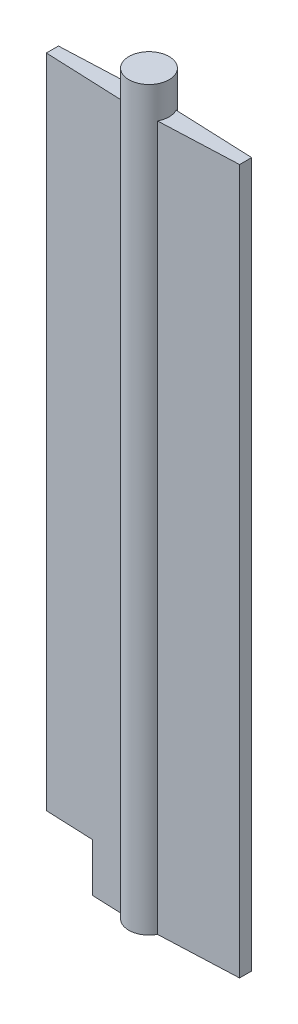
ISO-10303-21;
HEADER;
FILE_DESCRIPTION(('STEP AP214'),'2;1');
FILE_NAME('part.step','',(''),(''),'','','');
FILE_SCHEMA(('AUTOMOTIVE_DESIGN { 1 0 10303 214 1 1 1 1 }'));
ENDSEC;
DATA;
#1=APPLICATION_CONTEXT('core data for automotive mechanical design processes');
#2=APPLICATION_PROTOCOL_DEFINITION('international standard','automotive_design',2000,#1);
#3=PRODUCT_CONTEXT('',#1,'mechanical');
#4=PRODUCT('Part','Part','',(#3));
#5=PRODUCT_RELATED_PRODUCT_CATEGORY('part','',(#4));
#6=PRODUCT_DEFINITION_FORMATION('','',#4);
#7=PRODUCT_DEFINITION_CONTEXT('part definition',#1,'design');
#8=PRODUCT_DEFINITION('design','',#6,#7);
#9=PRODUCT_DEFINITION_SHAPE('','',#8);
#10=(LENGTH_UNIT() NAMED_UNIT(*) SI_UNIT(.MILLI.,.METRE.));
#11=(NAMED_UNIT(*) PLANE_ANGLE_UNIT() SI_UNIT($,.RADIAN.));
#12=(NAMED_UNIT(*) SI_UNIT($,.STERADIAN.) SOLID_ANGLE_UNIT());
#13=UNCERTAINTY_MEASURE_WITH_UNIT(LENGTH_MEASURE(1.E-05),#10,'distance_accuracy_value','');
#14=(GEOMETRIC_REPRESENTATION_CONTEXT(3) GLOBAL_UNCERTAINTY_ASSIGNED_CONTEXT((#13)) GLOBAL_UNIT_ASSIGNED_CONTEXT((#10,
#11,#12)) REPRESENTATION_CONTEXT('',''));
#15=CARTESIAN_POINT('',(0.,0.,0.));
#16=DIRECTION('',(0.,0.,1.));
#17=DIRECTION('',(1.,0.,0.));
#18=AXIS2_PLACEMENT_3D('',#15,#16,#17);
#19=CARTESIAN_POINT('',(0.,222.25,0.));
#20=DIRECTION('',(0.,1.,0.));
#21=DIRECTION('',(0.,0.,1.));
#22=AXIS2_PLACEMENT_3D('',#19,#20,#21);
#23=PLANE('',#22);
#24=CARTESIAN_POINT('',(0.,222.25,0.));
#25=DIRECTION('',(0.,1.,0.));
#26=DIRECTION('',(0.,0.,1.));
#27=AXIS2_PLACEMENT_3D('',#24,#25,#26);
#28=CIRCLE('',#27,6.35);
#29=CARTESIAN_POINT('',(5.62814310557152,222.25,2.94049403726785));
#30=VERTEX_POINT('',#29);
#31=CARTESIAN_POINT('',(5.62814310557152,222.25,-2.94049403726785));
#32=VERTEX_POINT('',#31);
#33=EDGE_CURVE('E174',#30,#32,#28,.T.);
#34=ORIENTED_EDGE('',*,*,#33,.F.);
#35=DIRECTION('',(-0.999133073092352,0.,0.0416305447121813));
#36=VECTOR('',#35,1.);
#37=CARTESIAN_POINT('',(0.132062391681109,222.25,3.16949740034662));
#38=LINE('',#37,#36);
#39=CARTESIAN_POINT('',(30.48,222.25,1.905));
#40=VERTEX_POINT('',#39);
#41=EDGE_CURVE('E220',#40,#30,#38,.T.);
#42=ORIENTED_EDGE('',*,*,#41,.F.);
#43=DIRECTION('',(0.,0.,1.));
#44=VECTOR('',#43,1.);
#45=CARTESIAN_POINT('',(30.48,222.25,0.));
#46=LINE('',#45,#44);
#47=CARTESIAN_POINT('',(30.48,222.25,-1.905));
#48=VERTEX_POINT('',#47);
#49=EDGE_CURVE('E225',#48,#40,#46,.T.);
#50=ORIENTED_EDGE('',*,*,#49,.F.);
#51=DIRECTION('',(0.999133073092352,0.,0.0416305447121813));
#52=VECTOR('',#51,1.);
#53=CARTESIAN_POINT('',(0.132062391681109,222.25,-3.16949740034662));
#54=LINE('',#53,#52);
#55=EDGE_CURVE('E216',#32,#48,#54,.T.);
#56=ORIENTED_EDGE('',*,*,#55,.F.);
#57=EDGE_LOOP('',(#34,#42,#50,#56));
#58=FACE_BOUND('',#57,.T.);
#59=ADVANCED_FACE('F68',(#58),#23,.T.);
#60=CARTESIAN_POINT('',(0.132062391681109,222.25,3.16949740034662));
#61=DIRECTION('',(0.0416305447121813,0.,0.999133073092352));
#62=DIRECTION('',(0.999133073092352,0.,-0.0416305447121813));
#63=AXIS2_PLACEMENT_3D('',#60,#61,#62);
#64=PLANE('',#63);
#65=DIRECTION('',(-0.999133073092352,0.,0.0416305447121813));
#66=VECTOR('',#65,1.);
#67=CARTESIAN_POINT('',(0.132062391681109,0.,3.16949740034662));
#68=LINE('',#67,#66);
#69=CARTESIAN_POINT('',(30.48,0.,1.905));
#70=VERTEX_POINT('',#69);
#71=CARTESIAN_POINT('',(5.62814310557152,0.,2.94049403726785));
#72=VERTEX_POINT('',#71);
#73=EDGE_CURVE('E161',#70,#72,#68,.T.);
#74=ORIENTED_EDGE('',*,*,#73,.F.);
#75=DIRECTION('',(0.,-1.,0.));
#76=VECTOR('',#75,1.);
#77=CARTESIAN_POINT('',(30.48,222.25,1.905));
#78=LINE('',#77,#76);
#79=EDGE_CURVE('E175',#40,#70,#78,.T.);
#80=ORIENTED_EDGE('',*,*,#79,.F.);
#81=ORIENTED_EDGE('',*,*,#41,.T.);
#82=DIRECTION('',(0.,-1.,0.));
#83=VECTOR('',#82,1.);
#84=CARTESIAN_POINT('',(5.62814310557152,222.25,2.94049403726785));
#85=LINE('',#84,#83);
#86=EDGE_CURVE('E172',#30,#72,#85,.T.);
#87=ORIENTED_EDGE('',*,*,#86,.T.);
#88=EDGE_LOOP('',(#74,#80,#81,#87));
#89=FACE_BOUND('',#88,.T.);
#90=ADVANCED_FACE('F231',(#89),#64,.T.);
#91=CARTESIAN_POINT('',(30.48,222.25,0.));
#92=DIRECTION('',(1.,0.,0.));
#93=DIRECTION('',(0.,0.,-1.));
#94=AXIS2_PLACEMENT_3D('',#91,#92,#93);
#95=PLANE('',#94);
#96=DIRECTION('',(0.,0.,1.));
#97=VECTOR('',#96,1.);
#98=CARTESIAN_POINT('',(30.48,0.,0.));
#99=LINE('',#98,#97);
#100=CARTESIAN_POINT('',(30.48,0.,-1.905));
#101=VERTEX_POINT('',#100);
#102=EDGE_CURVE('E221',#101,#70,#99,.T.);
#103=ORIENTED_EDGE('',*,*,#102,.F.);
#104=DIRECTION('',(0.,-1.,0.));
#105=VECTOR('',#104,1.);
#106=CARTESIAN_POINT('',(30.48,222.25,-1.905));
#107=LINE('',#106,#105);
#108=EDGE_CURVE('E213',#48,#101,#107,.T.);
#109=ORIENTED_EDGE('',*,*,#108,.F.);
#110=ORIENTED_EDGE('',*,*,#49,.T.);
#111=ORIENTED_EDGE('',*,*,#79,.T.);
#112=EDGE_LOOP('',(#103,#109,#110,#111));
#113=FACE_BOUND('',#112,.T.);
#114=ADVANCED_FACE('F238',(#113),#95,.T.);
#115=CARTESIAN_POINT('',(0.132062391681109,222.25,-3.16949740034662));
#116=DIRECTION('',(0.0416305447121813,0.,-0.999133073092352));
#117=DIRECTION('',(-0.999133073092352,0.,-0.0416305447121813));
#118=AXIS2_PLACEMENT_3D('',#115,#116,#117);
#119=PLANE('',#118);
#120=DIRECTION('',(0.999133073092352,0.,0.0416305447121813));
#121=VECTOR('',#120,1.);
#122=CARTESIAN_POINT('',(0.132062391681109,0.,-3.16949740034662));
#123=LINE('',#122,#121);
#124=CARTESIAN_POINT('',(5.62814310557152,0.,-2.94049403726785));
#125=VERTEX_POINT('',#124);
#126=EDGE_CURVE('E217',#125,#101,#123,.T.);
#127=ORIENTED_EDGE('',*,*,#126,.F.);
#128=DIRECTION('',(0.,-1.,0.));
#129=VECTOR('',#128,1.);
#130=CARTESIAN_POINT('',(5.62814310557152,222.25,-2.94049403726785));
#131=LINE('',#130,#129);
#132=EDGE_CURVE('E92',#32,#125,#131,.T.);
#133=ORIENTED_EDGE('',*,*,#132,.F.);
#134=ORIENTED_EDGE('',*,*,#55,.T.);
#135=ORIENTED_EDGE('',*,*,#108,.T.);
#136=EDGE_LOOP('',(#127,#133,#134,#135));
#137=FACE_BOUND('',#136,.T.);
#138=ADVANCED_FACE('F235',(#137),#119,.T.);
#139=CARTESIAN_POINT('',(0.,0.,0.));
#140=DIRECTION('',(0.,1.,0.));
#141=DIRECTION('',(0.,0.,1.));
#142=AXIS2_PLACEMENT_3D('',#139,#140,#141);
#143=PLANE('',#142);
#144=DIRECTION('',(0.999133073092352,0.,0.0416305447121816));
#145=VECTOR('',#144,1.);
#146=CARTESIAN_POINT('',(-0.13206239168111,0.,3.16949740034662));
#147=LINE('',#146,#145);
#148=CARTESIAN_POINT('',(-15.24,0.,2.53999999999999));
#149=VERTEX_POINT('',#148);
#150=CARTESIAN_POINT('',(-5.62814310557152,0.,2.94049403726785));
#151=VERTEX_POINT('',#150);
#152=EDGE_CURVE('E130',#149,#151,#147,.T.);
#153=ORIENTED_EDGE('',*,*,#152,.F.);
#154=DIRECTION('',(0.,0.,1.));
#155=VECTOR('',#154,1.);
#156=CARTESIAN_POINT('',(-15.24,0.,-6.35));
#157=LINE('',#156,#155);
#158=CARTESIAN_POINT('',(-15.24,0.,-2.54));
#159=VERTEX_POINT('',#158);
#160=EDGE_CURVE('E189',#159,#149,#157,.T.);
#161=ORIENTED_EDGE('',*,*,#160,.F.);
#162=DIRECTION('',(-0.999133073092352,0.,0.0416305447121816));
#163=VECTOR('',#162,1.);
#164=CARTESIAN_POINT('',(-0.13206239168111,0.,-3.16949740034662));
#165=LINE('',#164,#163);
#166=CARTESIAN_POINT('',(-5.62814310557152,0.,-2.94049403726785));
#167=VERTEX_POINT('',#166);
#168=EDGE_CURVE('E144',#167,#159,#165,.T.);
#169=ORIENTED_EDGE('',*,*,#168,.F.);
#170=CARTESIAN_POINT('',(0.,0.,0.));
#171=DIRECTION('',(0.,1.,0.));
#172=DIRECTION('',(0.,0.,1.));
#173=AXIS2_PLACEMENT_3D('',#170,#171,#172);
#174=CIRCLE('',#173,6.35);
#175=EDGE_CURVE('E162',#125,#167,#174,.T.);
#176=ORIENTED_EDGE('',*,*,#175,.F.);
#177=ORIENTED_EDGE('',*,*,#126,.T.);
#178=ORIENTED_EDGE('',*,*,#102,.T.);
#179=ORIENTED_EDGE('',*,*,#73,.T.);
#180=EDGE_CURVE('E151',#151,#72,#174,.T.);
#181=ORIENTED_EDGE('',*,*,#180,.F.);
#182=EDGE_LOOP('',(#153,#161,#169,#176,#177,#178,#179,#181));
#183=FACE_BOUND('',#182,.T.);
#184=ADVANCED_FACE('F158',(#183),#143,.F.);
#185=CARTESIAN_POINT('',(-5.62814310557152,222.25,-2.94049403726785));
#186=VERTEX_POINT('',#185);
#187=CARTESIAN_POINT('',(-5.62814310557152,222.25,2.94049403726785));
#188=VERTEX_POINT('',#187);
#189=EDGE_CURVE('E154',#186,#188,#28,.T.);
#190=ORIENTED_EDGE('',*,*,#189,.F.);
#191=DIRECTION('',(-0.999133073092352,0.,0.0416305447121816));
#192=VECTOR('',#191,1.);
#193=CARTESIAN_POINT('',(-0.13206239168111,222.25,-3.16949740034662));
#194=LINE('',#193,#192);
#195=CARTESIAN_POINT('',(-30.48,222.25,-1.90499999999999));
#196=VERTEX_POINT('',#195);
#197=EDGE_CURVE('E143',#186,#196,#194,.T.);
#198=ORIENTED_EDGE('',*,*,#197,.T.);
#199=DIRECTION('',(0.,0.,1.));
#200=VECTOR('',#199,1.);
#201=CARTESIAN_POINT('',(-30.48,222.25,0.));
#202=LINE('',#201,#200);
#203=CARTESIAN_POINT('',(-30.48,222.25,1.90499999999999));
#204=VERTEX_POINT('',#203);
#205=EDGE_CURVE('E209',#196,#204,#202,.T.);
#206=ORIENTED_EDGE('',*,*,#205,.T.);
#207=DIRECTION('',(0.999133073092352,0.,0.0416305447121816));
#208=VECTOR('',#207,1.);
#209=CARTESIAN_POINT('',(-0.13206239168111,222.25,3.16949740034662));
#210=LINE('',#209,#208);
#211=EDGE_CURVE('E156',#204,#188,#210,.T.);
#212=ORIENTED_EDGE('',*,*,#211,.T.);
#213=EDGE_LOOP('',(#190,#198,#206,#212));
#214=FACE_BOUND('',#213,.T.);
#215=ADVANCED_FACE('F246',(#214),#23,.T.);
#216=CARTESIAN_POINT('',(-30.48,222.25,0.));
#217=DIRECTION('',(1.,0.,0.));
#218=DIRECTION('',(0.,0.,-1.));
#219=AXIS2_PLACEMENT_3D('',#216,#217,#218);
#220=PLANE('',#219);
#221=DIRECTION('',(0.,-1.,0.));
#222=VECTOR('',#221,1.);
#223=CARTESIAN_POINT('',(-30.48,222.25,-1.90499999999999));
#224=LINE('',#223,#222);
#225=CARTESIAN_POINT('',(-30.48,15.24,-1.90499999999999));
#226=VERTEX_POINT('',#225);
#227=EDGE_CURVE('E203',#196,#226,#224,.T.);
#228=ORIENTED_EDGE('',*,*,#227,.T.);
#229=DIRECTION('',(0.,0.,1.));
#230=VECTOR('',#229,1.);
#231=CARTESIAN_POINT('',(-30.48,15.24,-6.35));
#232=LINE('',#231,#230);
#233=CARTESIAN_POINT('',(-30.48,15.24,1.90499999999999));
#234=VERTEX_POINT('',#233);
#235=EDGE_CURVE('E186',#226,#234,#232,.T.);
#236=ORIENTED_EDGE('',*,*,#235,.T.);
#237=DIRECTION('',(0.,-1.,0.));
#238=VECTOR('',#237,1.);
#239=CARTESIAN_POINT('',(-30.48,222.25,1.90499999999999));
#240=LINE('',#239,#238);
#241=EDGE_CURVE('E155',#204,#234,#240,.T.);
#242=ORIENTED_EDGE('',*,*,#241,.F.);
#243=ORIENTED_EDGE('',*,*,#205,.F.);
#244=EDGE_LOOP('',(#228,#236,#242,#243));
#245=FACE_BOUND('',#244,.T.);
#246=ADVANCED_FACE('F199',(#245),#220,.F.);
#247=CARTESIAN_POINT('',(-0.13206239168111,222.25,3.16949740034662));
#248=DIRECTION('',(0.0416305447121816,0.,-0.999133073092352));
#249=DIRECTION('',(-0.999133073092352,0.,-0.0416305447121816));
#250=AXIS2_PLACEMENT_3D('',#247,#248,#249);
#251=PLANE('',#250);
#252=ORIENTED_EDGE('',*,*,#241,.T.);
#253=DIRECTION('',(0.999133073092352,0.,0.0416305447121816));
#254=VECTOR('',#253,1.);
#255=CARTESIAN_POINT('',(-0.13206239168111,15.24,3.16949740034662));
#256=LINE('',#255,#254);
#257=CARTESIAN_POINT('',(-15.24,15.24,2.54));
#258=VERTEX_POINT('',#257);
#259=EDGE_CURVE('E180',#234,#258,#256,.T.);
#260=ORIENTED_EDGE('',*,*,#259,.T.);
#261=DIRECTION('',(0.,-1.,0.));
#262=VECTOR('',#261,1.);
#263=CARTESIAN_POINT('',(-15.24,222.25,2.54));
#264=LINE('',#263,#262);
#265=EDGE_CURVE('E139',#258,#149,#264,.T.);
#266=ORIENTED_EDGE('',*,*,#265,.T.);
#267=ORIENTED_EDGE('',*,*,#152,.T.);
#268=DIRECTION('',(0.,-1.,0.));
#269=VECTOR('',#268,1.);
#270=CARTESIAN_POINT('',(-5.62814310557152,222.25,2.94049403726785));
#271=LINE('',#270,#269);
#272=EDGE_CURVE('E135',#188,#151,#271,.T.);
#273=ORIENTED_EDGE('',*,*,#272,.F.);
#274=ORIENTED_EDGE('',*,*,#211,.F.);
#275=EDGE_LOOP('',(#252,#260,#266,#267,#273,#274));
#276=FACE_BOUND('',#275,.T.);
#277=ADVANCED_FACE('F133',(#276),#251,.F.);
#278=CARTESIAN_POINT('',(-0.13206239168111,222.25,-3.16949740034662));
#279=DIRECTION('',(0.0416305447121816,0.,0.999133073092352));
#280=DIRECTION('',(0.999133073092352,0.,-0.0416305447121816));
#281=AXIS2_PLACEMENT_3D('',#278,#279,#280);
#282=PLANE('',#281);
#283=DIRECTION('',(0.,1.,0.));
#284=VECTOR('',#283,1.);
#285=CARTESIAN_POINT('',(-15.24,222.25,-2.54));
#286=LINE('',#285,#284);
#287=CARTESIAN_POINT('',(-15.24,15.24,-2.54));
#288=VERTEX_POINT('',#287);
#289=EDGE_CURVE('E76',#159,#288,#286,.T.);
#290=ORIENTED_EDGE('',*,*,#289,.T.);
#291=DIRECTION('',(-0.999133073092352,0.,0.0416305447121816));
#292=VECTOR('',#291,1.);
#293=CARTESIAN_POINT('',(-0.13206239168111,15.24,-3.16949740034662));
#294=LINE('',#293,#292);
#295=EDGE_CURVE('E12',#288,#226,#294,.T.);
#296=ORIENTED_EDGE('',*,*,#295,.T.);
#297=ORIENTED_EDGE('',*,*,#227,.F.);
#298=ORIENTED_EDGE('',*,*,#197,.F.);
#299=DIRECTION('',(0.,-1.,0.));
#300=VECTOR('',#299,1.);
#301=CARTESIAN_POINT('',(-5.62814310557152,222.25,-2.94049403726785));
#302=LINE('',#301,#300);
#303=EDGE_CURVE('E168',#186,#167,#302,.T.);
#304=ORIENTED_EDGE('',*,*,#303,.T.);
#305=ORIENTED_EDGE('',*,*,#168,.T.);
#306=EDGE_LOOP('',(#290,#296,#297,#298,#304,#305));
#307=FACE_BOUND('',#306,.T.);
#308=ADVANCED_FACE('F243',(#307),#282,.F.);
#309=CARTESIAN_POINT('',(0.,222.25,0.));
#310=DIRECTION('',(0.,-1.,0.));
#311=DIRECTION('',(0.,0.,-1.));
#312=AXIS2_PLACEMENT_3D('',#309,#310,#311);
#313=CYLINDRICAL_SURFACE('',#312,6.35);
#314=ORIENTED_EDGE('',*,*,#86,.F.);
#315=ORIENTED_EDGE('',*,*,#33,.T.);
#316=ORIENTED_EDGE('',*,*,#132,.T.);
#317=ORIENTED_EDGE('',*,*,#175,.T.);
#318=ORIENTED_EDGE('',*,*,#303,.F.);
#319=ORIENTED_EDGE('',*,*,#189,.T.);
#320=ORIENTED_EDGE('',*,*,#272,.T.);
#321=ORIENTED_EDGE('',*,*,#180,.T.);
#322=EDGE_LOOP('',(#314,#315,#316,#317,#318,#319,#320,#321));
#323=FACE_BOUND('',#322,.T.);
#324=CARTESIAN_POINT('',(0.,232.41,0.));
#325=DIRECTION('',(0.,1.,0.));
#326=DIRECTION('',(0.,0.,1.));
#327=AXIS2_PLACEMENT_3D('',#324,#325,#326);
#328=CIRCLE('',#327,6.35);
#329=CARTESIAN_POINT('',(0.,232.41,6.35));
#330=VERTEX_POINT('',#329);
#331=EDGE_CURVE('E166',#330,#330,#328,.T.);
#332=ORIENTED_EDGE('',*,*,#331,.F.);
#333=EDGE_LOOP('',(#332));
#334=FACE_BOUND('',#333,.T.);
#335=ADVANCED_FACE('F70',(#323,#334),#313,.T.);
#336=CARTESIAN_POINT('',(0.,232.41,0.));
#337=DIRECTION('',(0.,1.,0.));
#338=DIRECTION('',(0.,0.,1.));
#339=AXIS2_PLACEMENT_3D('',#336,#337,#338);
#340=PLANE('',#339);
#341=ORIENTED_EDGE('',*,*,#331,.T.);
#342=EDGE_LOOP('',(#341));
#343=FACE_BOUND('',#342,.T.);
#344=ADVANCED_FACE('F258',(#343),#340,.T.);
#345=CARTESIAN_POINT('',(-30.48,15.24,-6.35));
#346=DIRECTION('',(0.,1.,0.));
#347=DIRECTION('',(0.,0.,1.));
#348=AXIS2_PLACEMENT_3D('',#345,#346,#347);
#349=PLANE('',#348);
#350=ORIENTED_EDGE('',*,*,#235,.F.);
#351=ORIENTED_EDGE('',*,*,#295,.F.);
#352=DIRECTION('',(0.,0.,1.));
#353=VECTOR('',#352,1.);
#354=CARTESIAN_POINT('',(-15.24,15.24,-6.35));
#355=LINE('',#354,#353);
#356=EDGE_CURVE('E83',#288,#258,#355,.T.);
#357=ORIENTED_EDGE('',*,*,#356,.T.);
#358=ORIENTED_EDGE('',*,*,#259,.F.);
#359=EDGE_LOOP('',(#350,#351,#357,#358));
#360=FACE_BOUND('',#359,.T.);
#361=ADVANCED_FACE('F263',(#360),#349,.F.);
#362=CARTESIAN_POINT('',(-15.24,0.,-6.35));
#363=DIRECTION('',(1.,0.,0.));
#364=DIRECTION('',(0.,0.,-1.));
#365=AXIS2_PLACEMENT_3D('',#362,#363,#364);
#366=PLANE('',#365);
#367=ORIENTED_EDGE('',*,*,#356,.F.);
#368=ORIENTED_EDGE('',*,*,#289,.F.);
#369=ORIENTED_EDGE('',*,*,#160,.T.);
#370=ORIENTED_EDGE('',*,*,#265,.F.);
#371=EDGE_LOOP('',(#367,#368,#369,#370));
#372=FACE_BOUND('',#371,.T.);
#373=ADVANCED_FACE('F314',(#372),#366,.F.);
#374=CLOSED_SHELL('',(#59,#90,#114,#138,#184,#215,#246,#277,#308,#335,#344,#361,#373));
#375=MANIFOLD_SOLID_BREP('B2',#374);
#376=ADVANCED_BREP_SHAPE_REPRESENTATION('',(#18,#375),#14);
#377=SHAPE_DEFINITION_REPRESENTATION(#9,#376);
ENDSEC;
END-ISO-10303-21;
